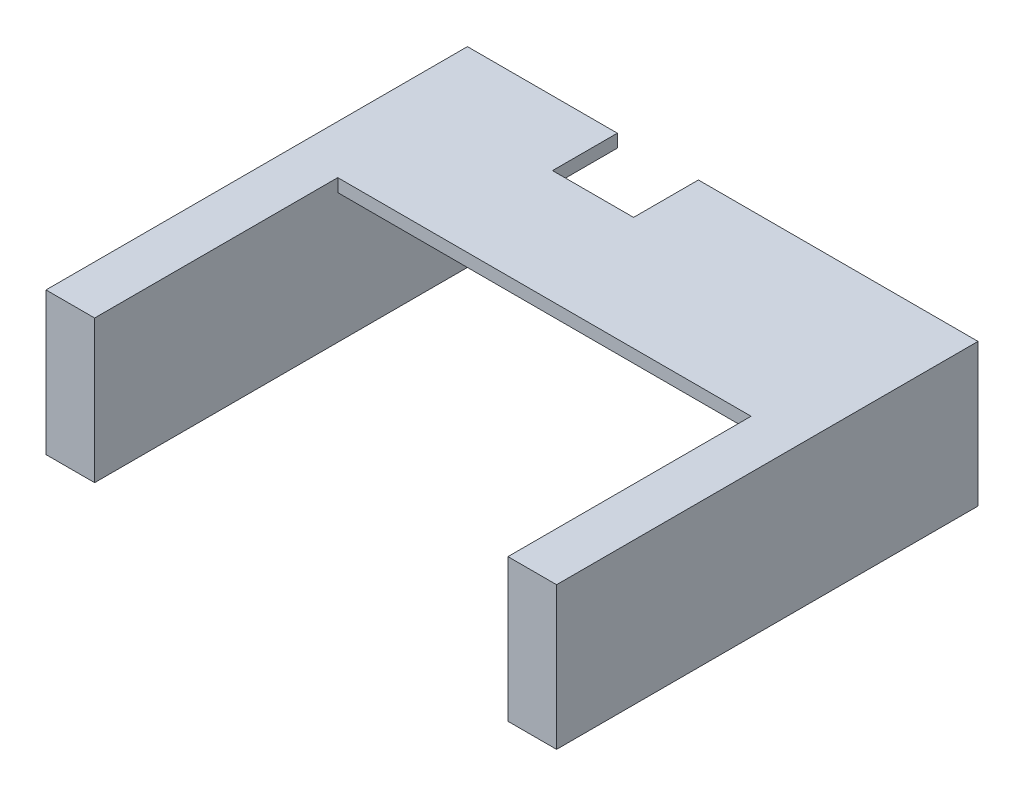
from build123d import *

# Parameters (mm, degrees)
ESQUISSE1_W             = 315
ESQUISSE1_H             = 88
BOSS_EXTRU_1_DEPTH      = 260
ESQUISSE3_W             = 255
ESQUISSE3_H             = 80
ENL_V_MAT_EXTRU_1_DEPTH = 418.814552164
ESQUISSE4_W             = 255
ESQUISSE4_H             = 150
ENL_V_MAT_EXTRU_2_DEPTH = 417.203075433
ESQUISSE5_W             = 50
ESQUISSE5_H             = 40
ENL_V_MAT_EXTRU_3_DEPTH = 418.814552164


with BuildPart() as part:
    # Esquisse1 → Boss.-Extru.1 (new body)
    with BuildSketch(Plane.XY):
        with Locations((157.5, 44)):
            Rectangle(ESQUISSE1_W, ESQUISSE1_H)
    extrude(amount=BOSS_EXTRU_1_DEPTH)

    # Esquisse3 → Enl_v. mat.-Extru.1 (cut, through all)
    with BuildSketch(Plane.XY.offset(260)):
        with Locations((157.5, 40)):
            Rectangle(ESQUISSE3_W, ESQUISSE3_H)
    extrude(amount=-ENL_V_MAT_EXTRU_1_DEPTH, mode=Mode.SUBTRACT)

    # Esquisse4 → Enl_v. mat.-Extru.2 (cut, through all)
    with BuildSketch(Plane.XZ.offset(-80)):
        with Locations((157.5, 185)):
            Rectangle(ESQUISSE4_W, ESQUISSE4_H)
    extrude(amount=-ENL_V_MAT_EXTRU_2_DEPTH, mode=Mode.SUBTRACT)

    # Esquisse5 → Enl_v. mat.-Extru.3 (cut, through all)
    with BuildSketch(Plane(origin=(0, 88, 0), x_dir=(1, 0, 0), z_dir=(0, 1, 0))):
        with Locations((117.5, -20)):
            Rectangle(ESQUISSE5_W, ESQUISSE5_H)
    extrude(amount=-ENL_V_MAT_EXTRU_3_DEPTH, mode=Mode.SUBTRACT)


solid = part.part
